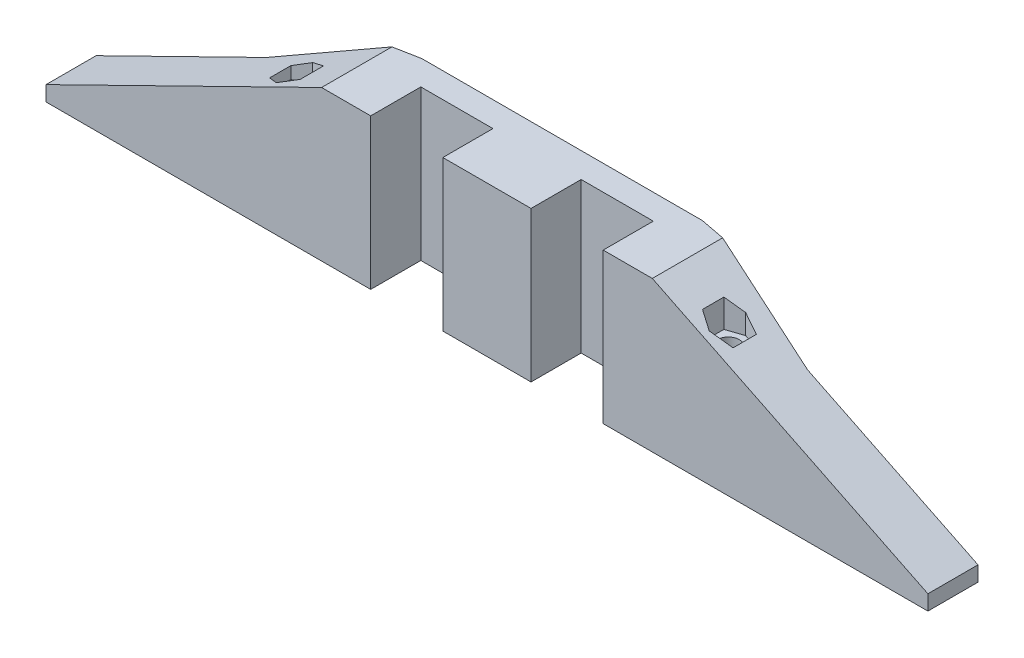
ISO-10303-21;
HEADER;
FILE_DESCRIPTION(('STEP AP214'),'2;1');
FILE_NAME('part.step','',(''),(''),'','','');
FILE_SCHEMA(('AUTOMOTIVE_DESIGN { 1 0 10303 214 1 1 1 1 }'));
ENDSEC;
DATA;
#1=APPLICATION_CONTEXT('core data for automotive mechanical design processes');
#2=APPLICATION_PROTOCOL_DEFINITION('international standard','automotive_design',2000,#1);
#3=PRODUCT_CONTEXT('',#1,'mechanical');
#4=PRODUCT('Part','Part','',(#3));
#5=PRODUCT_RELATED_PRODUCT_CATEGORY('part','',(#4));
#6=PRODUCT_DEFINITION_FORMATION('','',#4);
#7=PRODUCT_DEFINITION_CONTEXT('part definition',#1,'design');
#8=PRODUCT_DEFINITION('design','',#6,#7);
#9=PRODUCT_DEFINITION_SHAPE('','',#8);
#10=(LENGTH_UNIT() NAMED_UNIT(*) SI_UNIT(.MILLI.,.METRE.));
#11=(NAMED_UNIT(*) PLANE_ANGLE_UNIT() SI_UNIT($,.RADIAN.));
#12=(NAMED_UNIT(*) SI_UNIT($,.STERADIAN.) SOLID_ANGLE_UNIT());
#13=UNCERTAINTY_MEASURE_WITH_UNIT(LENGTH_MEASURE(1.E-05),#10,'distance_accuracy_value','');
#14=(GEOMETRIC_REPRESENTATION_CONTEXT(3) GLOBAL_UNCERTAINTY_ASSIGNED_CONTEXT((#13)) GLOBAL_UNIT_ASSIGNED_CONTEXT((#10,
#11,#12)) REPRESENTATION_CONTEXT('',''));
#15=CARTESIAN_POINT('',(0.,0.,0.));
#16=DIRECTION('',(0.,0.,1.));
#17=DIRECTION('',(1.,0.,0.));
#18=AXIS2_PLACEMENT_3D('',#15,#16,#17);
#19=CARTESIAN_POINT('',(-26.8621995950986,54.7192954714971,53.3666684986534));
#20=DIRECTION('',(0.440673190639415,-0.89766761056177,0.));
#21=DIRECTION('',(0.89766761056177,0.440673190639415,0.));
#22=AXIS2_PLACEMENT_3D('',#19,#20,#21);
#23=PLANE('',#22);
#24=DIRECTION('',(0.,0.,-1.));
#25=VECTOR('',#24,1.);
#26=CARTESIAN_POINT('',(-132.21632,3.,53.3666684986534));
#27=LINE('',#26,#25);
#28=CARTESIAN_POINT('',(-132.21632,3.,-7.9032262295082));
#29=VERTEX_POINT('',#28);
#30=CARTESIAN_POINT('',(-132.21632,3.,-17.9032262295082));
#31=VERTEX_POINT('',#30);
#32=EDGE_CURVE('E329',#29,#31,#27,.T.);
#33=ORIENTED_EDGE('',*,*,#32,.F.);
#34=DIRECTION('',(0.89766761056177,0.440673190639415,0.));
#35=VECTOR('',#34,1.);
#36=CARTESIAN_POINT('',(-26.8621995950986,54.7192954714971,-7.9032262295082));
#37=LINE('',#36,#35);
#38=CARTESIAN_POINT('',(-77.21632,30.,-7.9032262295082));
#39=VERTEX_POINT('',#38);
#40=EDGE_CURVE('E328',#29,#39,#37,.T.);
#41=ORIENTED_EDGE('',*,*,#40,.T.);
#42=DIRECTION('',(0.,0.,-1.));
#43=VECTOR('',#42,1.);
#44=CARTESIAN_POINT('',(-77.21632,30.,53.3666684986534));
#45=LINE('',#44,#43);
#46=CARTESIAN_POINT('',(-77.21632,30.,-21.9416877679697));
#47=VERTEX_POINT('',#46);
#48=EDGE_CURVE('E316',#39,#47,#45,.T.);
#49=ORIENTED_EDGE('',*,*,#48,.T.);
#50=DIRECTION('',(0.884583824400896,0.434250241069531,-0.170112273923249));
#51=VECTOR('',#50,1.);
#52=CARTESIAN_POINT('',(-9.92678716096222,63.0330433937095,-34.8819825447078));
#53=LINE('',#52,#51);
#54=CARTESIAN_POINT('',(-98.2163199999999,19.6909090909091,-17.9032262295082));
#55=VERTEX_POINT('',#54);
#56=EDGE_CURVE('E448',#55,#47,#53,.T.);
#57=ORIENTED_EDGE('',*,*,#56,.F.);
#58=DIRECTION('',(0.89766761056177,0.440673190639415,0.));
#59=VECTOR('',#58,1.);
#60=CARTESIAN_POINT('',(-133.40305415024,2.41742141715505,-17.9032262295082));
#61=LINE('',#60,#59);
#62=EDGE_CURVE('E322',#31,#55,#61,.T.);
#63=ORIENTED_EDGE('',*,*,#62,.F.);
#64=EDGE_LOOP('',(#33,#41,#49,#57,#63));
#65=FACE_BOUND('',#64,.T.);
#66=DIRECTION('',(-0.859150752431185,-0.421764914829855,0.289783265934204));
#67=VECTOR('',#66,1.);
#68=CARTESIAN_POINT('',(-49.3001737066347,43.7042899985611,-29.1893241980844));
#69=LINE('',#68,#67);
#70=CARTESIAN_POINT('',(-87.41632,24.9927272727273,-16.3331155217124));
#71=VERTEX_POINT('',#70);
#72=CARTESIAN_POINT('',(-90.66632,23.3972727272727,-15.2369218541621));
#73=VERTEX_POINT('',#72);
#74=EDGE_CURVE('E11',#71,#73,#69,.T.);
#75=ORIENTED_EDGE('',*,*,#74,.F.);
#76=DIRECTION('',(-0.859150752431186,-0.421764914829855,-0.289783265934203));
#77=VECTOR('',#76,1.);
#78=CARTESIAN_POINT('',(-14.594210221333,60.7417629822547,8.22908004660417));
#79=LINE('',#78,#77);
#80=CARTESIAN_POINT('',(-84.16632,26.5881818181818,-15.2369218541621));
#81=VERTEX_POINT('',#80);
#82=EDGE_CURVE('E45',#81,#71,#79,.T.);
#83=ORIENTED_EDGE('',*,*,#82,.F.);
#84=DIRECTION('',(0.,0.,-1.));
#85=VECTOR('',#84,1.);
#86=CARTESIAN_POINT('',(-84.1663199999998,26.5881818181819,53.3666684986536));
#87=LINE('',#86,#85);
#88=CARTESIAN_POINT('',(-84.16632,26.5881818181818,-10.5695306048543));
#89=VERTEX_POINT('',#88);
#90=EDGE_CURVE('E477',#89,#81,#87,.T.);
#91=ORIENTED_EDGE('',*,*,#90,.F.);
#92=DIRECTION('',(-0.859150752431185,-0.421764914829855,0.289783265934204));
#93=VECTOR('',#92,1.);
#94=CARTESIAN_POINT('',(-47.5923117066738,44.5426949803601,-22.9055910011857));
#95=LINE('',#94,#93);
#96=CARTESIAN_POINT('',(-87.7231647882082,24.8420943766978,-9.36984114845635));
#97=VERTEX_POINT('',#96);
#98=EDGE_CURVE('E474',#89,#97,#95,.T.);
#99=ORIENTED_EDGE('',*,*,#98,.T.);
#100=DIRECTION('',(-0.80650539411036,-0.395920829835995,-0.439085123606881));
#101=VECTOR('',#100,1.);
#102=CARTESIAN_POINT('',(-16.3793983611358,59.8653978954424,29.4717918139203));
#103=LINE('',#102,#101);
#104=CARTESIAN_POINT('',(-90.66632,23.3972727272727,-10.9721809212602));
#105=VERTEX_POINT('',#104);
#106=EDGE_CURVE('E471',#97,#105,#103,.T.);
#107=ORIENTED_EDGE('',*,*,#106,.T.);
#108=DIRECTION('',(0.,0.,-1.));
#109=VECTOR('',#108,1.);
#110=CARTESIAN_POINT('',(-90.66632,23.3972727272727,53.3666684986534));
#111=LINE('',#110,#109);
#112=EDGE_CURVE('E469',#105,#73,#111,.T.);
#113=ORIENTED_EDGE('',*,*,#112,.T.);
#114=EDGE_LOOP('',(#75,#83,#91,#99,#107,#113));
#115=FACE_BOUND('',#114,.T.);
#116=ADVANCED_FACE('F37',(#65,#115),#23,.F.);
#117=CARTESIAN_POINT('',(9.68921223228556,19.737284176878,53.3666684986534));
#118=DIRECTION('',(0.440673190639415,0.89766761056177,0.));
#119=DIRECTION('',(-0.89766761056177,0.440673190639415,0.));
#120=AXIS2_PLACEMENT_3D('',#117,#118,#119);
#121=PLANE('',#120);
#122=DIRECTION('',(0.884583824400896,-0.434250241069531,0.170112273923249));
#123=VECTOR('',#122,1.);
#124=CARTESIAN_POINT('',(-9.30832526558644,29.0633480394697,-21.5747657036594));
#125=LINE('',#124,#123);
#126=CARTESIAN_POINT('',(-11.21632,30.,-21.9416877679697));
#127=VERTEX_POINT('',#126);
#128=CARTESIAN_POINT('',(9.78368000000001,19.6909090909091,-17.9032262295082));
#129=VERTEX_POINT('',#128);
#130=EDGE_CURVE('E451',#127,#129,#125,.T.);
#131=ORIENTED_EDGE('',*,*,#130,.F.);
#132=DIRECTION('',(0.,0.,-1.));
#133=VECTOR('',#132,1.);
#134=CARTESIAN_POINT('',(-11.21632,30.,53.3666684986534));
#135=LINE('',#134,#133);
#136=CARTESIAN_POINT('',(-11.21632,30.,-7.9032262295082));
#137=VERTEX_POINT('',#136);
#138=EDGE_CURVE('E325',#137,#127,#135,.T.);
#139=ORIENTED_EDGE('',*,*,#138,.F.);
#140=DIRECTION('',(-0.89766761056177,0.440673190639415,0.));
#141=VECTOR('',#140,1.);
#142=CARTESIAN_POINT('',(9.68921223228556,19.737284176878,-7.9032262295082));
#143=LINE('',#142,#141);
#144=CARTESIAN_POINT('',(43.78368,3.,-7.9032262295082));
#145=VERTEX_POINT('',#144);
#146=EDGE_CURVE('E319',#145,#137,#143,.T.);
#147=ORIENTED_EDGE('',*,*,#146,.F.);
#148=DIRECTION('',(0.,0.,-1.));
#149=VECTOR('',#148,1.);
#150=CARTESIAN_POINT('',(43.78368,3.,53.3666684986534));
#151=LINE('',#150,#149);
#152=CARTESIAN_POINT('',(43.78368,3.,-17.9032262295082));
#153=VERTEX_POINT('',#152);
#154=EDGE_CURVE('E323',#145,#153,#151,.T.);
#155=ORIENTED_EDGE('',*,*,#154,.T.);
#156=DIRECTION('',(0.89766761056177,-0.440673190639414,0.));
#157=VECTOR('',#156,1.);
#158=CARTESIAN_POINT('',(44.9704141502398,2.41742141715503,-17.9032262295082));
#159=LINE('',#158,#157);
#160=EDGE_CURVE('E336',#129,#153,#159,.T.);
#161=ORIENTED_EDGE('',*,*,#160,.F.);
#162=EDGE_LOOP('',(#131,#139,#147,#155,#161));
#163=FACE_BOUND('',#162,.T.);
#164=DIRECTION('',(0.859150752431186,-0.421764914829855,0.289783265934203));
#165=VECTOR('',#164,1.);
#166=CARTESIAN_POINT('',(26.143203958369,11.6598700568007,-7.17246992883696));
#167=LINE('',#166,#165);
#168=CARTESIAN_POINT('',(-1.01631999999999,24.9927272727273,-16.3331155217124));
#169=VERTEX_POINT('',#168);
#170=CARTESIAN_POINT('',(2.23367999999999,23.3972727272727,-15.2369218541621));
#171=VERTEX_POINT('',#170);
#172=EDGE_CURVE('E454',#169,#171,#167,.T.);
#173=ORIENTED_EDGE('',*,*,#172,.T.);
#174=DIRECTION('',(0.,0.,1.));
#175=VECTOR('',#174,1.);
#176=CARTESIAN_POINT('',(2.2336800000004,23.3972727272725,53.3666684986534));
#177=LINE('',#176,#175);
#178=CARTESIAN_POINT('',(2.23368000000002,23.3972727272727,-10.5695306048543));
#179=VERTEX_POINT('',#178);
#180=EDGE_CURVE('E466',#171,#179,#177,.T.);
#181=ORIENTED_EDGE('',*,*,#180,.T.);
#182=DIRECTION('',(0.859150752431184,-0.421764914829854,-0.28978326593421));
#183=VECTOR('',#182,1.);
#184=CARTESIAN_POINT('',(-6.85489752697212,27.8589380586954,-7.50404102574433));
#185=LINE('',#184,#183);
#186=CARTESIAN_POINT('',(-1.32316478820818,25.1433601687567,-9.36984114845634));
#187=VERTEX_POINT('',#186);
#188=EDGE_CURVE('E464',#187,#179,#185,.T.);
#189=ORIENTED_EDGE('',*,*,#188,.F.);
#190=DIRECTION('',(0.806505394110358,-0.395920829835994,0.439085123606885));
#191=VECTOR('',#190,1.);
#192=CARTESIAN_POINT('',(29.7826091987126,9.87325293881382,7.56505192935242));
#193=LINE('',#192,#191);
#194=CARTESIAN_POINT('',(-4.26631999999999,26.5881818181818,-10.9721809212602));
#195=VERTEX_POINT('',#194);
#196=EDGE_CURVE('E462',#195,#187,#193,.T.);
#197=ORIENTED_EDGE('',*,*,#196,.F.);
#198=DIRECTION('',(0.,0.,1.));
#199=VECTOR('',#198,1.);
#200=CARTESIAN_POINT('',(-4.26631999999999,26.5881818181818,53.3666684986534));
#201=LINE('',#200,#199);
#202=CARTESIAN_POINT('',(-4.26631999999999,26.5881818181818,-15.2369218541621));
#203=VERTEX_POINT('',#202);
#204=EDGE_CURVE('E460',#203,#195,#201,.T.);
#205=ORIENTED_EDGE('',*,*,#204,.F.);
#206=DIRECTION('',(0.859150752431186,-0.421764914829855,-0.289783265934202));
#207=VECTOR('',#206,1.);
#208=CARTESIAN_POINT('',(-8.56275952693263,28.6973430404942,-13.7877742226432));
#209=LINE('',#208,#207);
#210=EDGE_CURVE('E457',#203,#169,#209,.T.);
#211=ORIENTED_EDGE('',*,*,#210,.T.);
#212=EDGE_LOOP('',(#173,#181,#189,#197,#205,#211));
#213=FACE_BOUND('',#212,.T.);
#214=ADVANCED_FACE('F501',(#163,#213),#121,.T.);
#215=CARTESIAN_POINT('',(-1.01631999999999,60.,-12.9032262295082));
#216=DIRECTION('',(0.,-1.,0.));
#217=DIRECTION('',(0.,0.,-1.));
#218=AXIS2_PLACEMENT_3D('',#215,#216,#217);
#219=CYLINDRICAL_SURFACE('',#218,2.1);
#220=CARTESIAN_POINT('',(-1.01631999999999,0.,-12.9032262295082));
#221=DIRECTION('',(0.,-1.,0.));
#222=DIRECTION('',(0.,0.,-1.));
#223=AXIS2_PLACEMENT_3D('',#220,#221,#222);
#224=CIRCLE('',#223,2.1);
#225=CARTESIAN_POINT('',(-1.01631999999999,0.,-15.0032262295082));
#226=VERTEX_POINT('',#225);
#227=EDGE_CURVE('E313',#226,#226,#224,.T.);
#228=CARTESIAN_POINT('',(-1.01631999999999,21.,-12.9032262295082));
#229=DIRECTION('',(0.,1.,0.));
#230=DIRECTION('',(0.,0.,1.));
#231=AXIS2_PLACEMENT_3D('',#228,#229,#230);
#232=CIRCLE('',#231,2.1);
#233=CARTESIAN_POINT('',(-1.01631999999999,21.,-15.0032262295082));
#234=VERTEX_POINT('',#233);
#235=EDGE_CURVE('E295',#234,#234,#232,.T.);
#236=CARTESIAN_POINT('',(-1.01631999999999,0.,-15.0032262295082));
#237=CARTESIAN_POINT('',(-1.01631999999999,0.218749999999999,-15.0032262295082));
#238=CARTESIAN_POINT('',(-1.01631999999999,0.437499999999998,-15.0032262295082));
#239=CARTESIAN_POINT('',(-1.01631999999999,0.874999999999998,-15.0032262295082));
#240=CARTESIAN_POINT('',(-1.01631999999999,1.09375,-15.0032262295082));
#241=CARTESIAN_POINT('',(-1.01631999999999,1.53125,-15.0032262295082));
#242=CARTESIAN_POINT('',(-1.01631999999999,1.75,-15.0032262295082));
#243=CARTESIAN_POINT('',(-1.01631999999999,2.1875,-15.0032262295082));
#244=CARTESIAN_POINT('',(-1.01631999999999,2.40625,-15.0032262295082));
#245=CARTESIAN_POINT('',(-1.01631999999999,2.84375,-15.0032262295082));
#246=CARTESIAN_POINT('',(-1.01631999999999,3.0625,-15.0032262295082));
#247=CARTESIAN_POINT('',(-1.01631999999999,3.5,-15.0032262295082));
#248=CARTESIAN_POINT('',(-1.01631999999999,3.71875,-15.0032262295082));
#249=CARTESIAN_POINT('',(-1.01631999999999,4.15625,-15.0032262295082));
#250=CARTESIAN_POINT('',(-1.01631999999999,4.375,-15.0032262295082));
#251=CARTESIAN_POINT('',(-1.01631999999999,4.8125,-15.0032262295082));
#252=CARTESIAN_POINT('',(-1.01631999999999,5.03125,-15.0032262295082));
#253=CARTESIAN_POINT('',(-1.01631999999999,5.46875,-15.0032262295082));
#254=CARTESIAN_POINT('',(-1.01631999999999,5.6875,-15.0032262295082));
#255=CARTESIAN_POINT('',(-1.01631999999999,6.125,-15.0032262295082));
#256=CARTESIAN_POINT('',(-1.01631999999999,6.34375,-15.0032262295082));
#257=CARTESIAN_POINT('',(-1.01631999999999,6.78125,-15.0032262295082));
#258=CARTESIAN_POINT('',(-1.01631999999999,7.,-15.0032262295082));
#259=CARTESIAN_POINT('',(-1.01631999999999,7.4375,-15.0032262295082));
#260=CARTESIAN_POINT('',(-1.01631999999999,7.65624999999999,-15.0032262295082));
#261=CARTESIAN_POINT('',(-1.01631999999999,8.09374999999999,-15.0032262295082));
#262=CARTESIAN_POINT('',(-1.01631999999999,8.31249999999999,-15.0032262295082));
#263=CARTESIAN_POINT('',(-1.01631999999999,8.75,-15.0032262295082));
#264=CARTESIAN_POINT('',(-1.01631999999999,8.96875,-15.0032262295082));
#265=CARTESIAN_POINT('',(-1.01631999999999,9.40625,-15.0032262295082));
#266=CARTESIAN_POINT('',(-1.01631999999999,9.625,-15.0032262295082));
#267=CARTESIAN_POINT('',(-1.01631999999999,10.0625,-15.0032262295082));
#268=CARTESIAN_POINT('',(-1.01631999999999,10.28125,-15.0032262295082));
#269=CARTESIAN_POINT('',(-1.01631999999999,10.71875,-15.0032262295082));
#270=CARTESIAN_POINT('',(-1.01631999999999,10.9375,-15.0032262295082));
#271=CARTESIAN_POINT('',(-1.01631999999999,11.375,-15.0032262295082));
#272=CARTESIAN_POINT('',(-1.01631999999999,11.59375,-15.0032262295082));
#273=CARTESIAN_POINT('',(-1.01631999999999,12.03125,-15.0032262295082));
#274=CARTESIAN_POINT('',(-1.01631999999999,12.25,-15.0032262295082));
#275=CARTESIAN_POINT('',(-1.01631999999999,12.6875,-15.0032262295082));
#276=CARTESIAN_POINT('',(-1.01631999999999,12.90625,-15.0032262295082));
#277=CARTESIAN_POINT('',(-1.01631999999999,13.34375,-15.0032262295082));
#278=CARTESIAN_POINT('',(-1.01631999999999,13.5625,-15.0032262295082));
#279=CARTESIAN_POINT('',(-1.01631999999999,14.,-15.0032262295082));
#280=CARTESIAN_POINT('',(-1.01631999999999,14.21875,-15.0032262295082));
#281=CARTESIAN_POINT('',(-1.01631999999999,14.65625,-15.0032262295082));
#282=CARTESIAN_POINT('',(-1.01631999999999,14.875,-15.0032262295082));
#283=CARTESIAN_POINT('',(-1.01631999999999,15.3125,-15.0032262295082));
#284=CARTESIAN_POINT('',(-1.01631999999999,15.53125,-15.0032262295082));
#285=CARTESIAN_POINT('',(-1.01631999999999,15.96875,-15.0032262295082));
#286=CARTESIAN_POINT('',(-1.01631999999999,16.1875,-15.0032262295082));
#287=CARTESIAN_POINT('',(-1.01631999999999,16.625,-15.0032262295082));
#288=CARTESIAN_POINT('',(-1.01631999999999,16.84375,-15.0032262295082));
#289=CARTESIAN_POINT('',(-1.01631999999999,17.28125,-15.0032262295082));
#290=CARTESIAN_POINT('',(-1.01631999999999,17.5,-15.0032262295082));
#291=CARTESIAN_POINT('',(-1.01631999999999,17.9375,-15.0032262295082));
#292=CARTESIAN_POINT('',(-1.01631999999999,18.15625,-15.0032262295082));
#293=CARTESIAN_POINT('',(-1.01631999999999,18.59375,-15.0032262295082));
#294=CARTESIAN_POINT('',(-1.01631999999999,18.8125,-15.0032262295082));
#295=CARTESIAN_POINT('',(-1.01631999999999,19.25,-15.0032262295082));
#296=CARTESIAN_POINT('',(-1.01631999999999,19.46875,-15.0032262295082));
#297=CARTESIAN_POINT('',(-1.01631999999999,19.90625,-15.0032262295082));
#298=CARTESIAN_POINT('',(-1.01631999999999,20.125,-15.0032262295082));
#299=CARTESIAN_POINT('',(-1.01631999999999,20.5625,-15.0032262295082));
#300=CARTESIAN_POINT('',(-1.01631999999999,20.78125,-15.0032262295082));
#301=CARTESIAN_POINT('',(-1.01631999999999,21.,-15.0032262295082));
#302=B_SPLINE_CURVE_WITH_KNOTS('',3,(#236,#237,#238,#239,#240,#241,#242,#243,#244,#245,#246,
#247,#248,#249,#250,#251,#252,#253,#254,#255,#256,#257,#258,#259,#260,#261,#262,#263,#264,#265,
#266,#267,#268,#269,#270,#271,#272,#273,#274,#275,#276,#277,#278,#279,#280,#281,#282,#283,#284,
#285,#286,#287,#288,#289,#290,#291,#292,#293,#294,#295,#296,#297,#298,#299,#300,#301),
.UNSPECIFIED.,.F.,.F.,(4,2,2,2,2,2,2,2,2,2,2,2,2,2,2,2,2,2,2,2,2,2,2,2,2,2,2,2,2,2,2,2,4),(0.,
0.656249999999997,1.3125,1.96875,2.625,3.28125,3.9375,4.59375,5.25,5.90624999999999,6.5625,
7.21875,7.87499999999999,8.53125,9.18749999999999,9.84375,10.5,11.15625,11.8125,12.46875,13.125,
13.78125,14.4375,15.09375,15.75,16.40625,17.0625,17.71875,18.375,19.03125,19.6875,20.34375,21.),.UNSPECIFIED.);
#303=EDGE_CURVE('BSEAM507',#226,#234,#302,.T.);
#304=ORIENTED_EDGE('',*,*,#227,.T.);
#305=ORIENTED_EDGE('',*,*,#235,.T.);
#306=ORIENTED_EDGE('',*,*,#303,.T.);
#307=ORIENTED_EDGE('',*,*,#303,.F.);
#308=EDGE_LOOP('',(#304,#306,#305,#307));
#309=FACE_BOUND('',#308,.T.);
#310=ADVANCED_FACE('F507',(#309),#219,.F.);
#311=CARTESIAN_POINT('',(-87.41632,60.,-12.9032262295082));
#312=DIRECTION('',(0.,-1.,0.));
#313=DIRECTION('',(0.,0.,-1.));
#314=AXIS2_PLACEMENT_3D('',#311,#312,#313);
#315=CYLINDRICAL_SURFACE('',#314,2.1);
#316=CARTESIAN_POINT('',(-87.41632,0.,-12.9032262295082));
#317=DIRECTION('',(0.,-1.,0.));
#318=DIRECTION('',(0.,0.,-1.));
#319=AXIS2_PLACEMENT_3D('',#316,#317,#318);
#320=CIRCLE('',#319,2.1);
#321=CARTESIAN_POINT('',(-87.41632,0.,-15.0032262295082));
#322=VERTEX_POINT('',#321);
#323=EDGE_CURVE('E269',#322,#322,#320,.T.);
#324=CARTESIAN_POINT('',(-87.41632,21.,-12.9032262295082));
#325=DIRECTION('',(0.,1.,0.));
#326=DIRECTION('',(0.,0.,1.));
#327=AXIS2_PLACEMENT_3D('',#324,#325,#326);
#328=CIRCLE('',#327,2.1);
#329=CARTESIAN_POINT('',(-87.41632,21.,-15.0032262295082));
#330=VERTEX_POINT('',#329);
#331=EDGE_CURVE('E240',#330,#330,#328,.T.);
#332=CARTESIAN_POINT('',(-87.41632,0.,-15.0032262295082));
#333=CARTESIAN_POINT('',(-87.41632,0.218749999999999,-15.0032262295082));
#334=CARTESIAN_POINT('',(-87.41632,0.437499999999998,-15.0032262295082));
#335=CARTESIAN_POINT('',(-87.41632,0.874999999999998,-15.0032262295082));
#336=CARTESIAN_POINT('',(-87.41632,1.09375,-15.0032262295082));
#337=CARTESIAN_POINT('',(-87.41632,1.53125,-15.0032262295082));
#338=CARTESIAN_POINT('',(-87.41632,1.75,-15.0032262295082));
#339=CARTESIAN_POINT('',(-87.41632,2.1875,-15.0032262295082));
#340=CARTESIAN_POINT('',(-87.41632,2.40625,-15.0032262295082));
#341=CARTESIAN_POINT('',(-87.41632,2.84375,-15.0032262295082));
#342=CARTESIAN_POINT('',(-87.41632,3.0625,-15.0032262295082));
#343=CARTESIAN_POINT('',(-87.41632,3.5,-15.0032262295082));
#344=CARTESIAN_POINT('',(-87.41632,3.71875,-15.0032262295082));
#345=CARTESIAN_POINT('',(-87.41632,4.15625,-15.0032262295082));
#346=CARTESIAN_POINT('',(-87.41632,4.375,-15.0032262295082));
#347=CARTESIAN_POINT('',(-87.41632,4.8125,-15.0032262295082));
#348=CARTESIAN_POINT('',(-87.41632,5.03125,-15.0032262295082));
#349=CARTESIAN_POINT('',(-87.41632,5.46875,-15.0032262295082));
#350=CARTESIAN_POINT('',(-87.41632,5.6875,-15.0032262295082));
#351=CARTESIAN_POINT('',(-87.41632,6.125,-15.0032262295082));
#352=CARTESIAN_POINT('',(-87.41632,6.34375,-15.0032262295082));
#353=CARTESIAN_POINT('',(-87.41632,6.78125,-15.0032262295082));
#354=CARTESIAN_POINT('',(-87.41632,7.,-15.0032262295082));
#355=CARTESIAN_POINT('',(-87.41632,7.4375,-15.0032262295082));
#356=CARTESIAN_POINT('',(-87.41632,7.65624999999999,-15.0032262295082));
#357=CARTESIAN_POINT('',(-87.41632,8.09374999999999,-15.0032262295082));
#358=CARTESIAN_POINT('',(-87.41632,8.31249999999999,-15.0032262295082));
#359=CARTESIAN_POINT('',(-87.41632,8.75,-15.0032262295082));
#360=CARTESIAN_POINT('',(-87.41632,8.96875,-15.0032262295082));
#361=CARTESIAN_POINT('',(-87.41632,9.40625,-15.0032262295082));
#362=CARTESIAN_POINT('',(-87.41632,9.625,-15.0032262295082));
#363=CARTESIAN_POINT('',(-87.41632,10.0625,-15.0032262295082));
#364=CARTESIAN_POINT('',(-87.41632,10.28125,-15.0032262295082));
#365=CARTESIAN_POINT('',(-87.41632,10.71875,-15.0032262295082));
#366=CARTESIAN_POINT('',(-87.41632,10.9375,-15.0032262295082));
#367=CARTESIAN_POINT('',(-87.41632,11.375,-15.0032262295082));
#368=CARTESIAN_POINT('',(-87.41632,11.59375,-15.0032262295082));
#369=CARTESIAN_POINT('',(-87.41632,12.03125,-15.0032262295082));
#370=CARTESIAN_POINT('',(-87.41632,12.25,-15.0032262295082));
#371=CARTESIAN_POINT('',(-87.41632,12.6875,-15.0032262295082));
#372=CARTESIAN_POINT('',(-87.41632,12.90625,-15.0032262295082));
#373=CARTESIAN_POINT('',(-87.41632,13.34375,-15.0032262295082));
#374=CARTESIAN_POINT('',(-87.41632,13.5625,-15.0032262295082));
#375=CARTESIAN_POINT('',(-87.41632,14.,-15.0032262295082));
#376=CARTESIAN_POINT('',(-87.41632,14.21875,-15.0032262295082));
#377=CARTESIAN_POINT('',(-87.41632,14.65625,-15.0032262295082));
#378=CARTESIAN_POINT('',(-87.41632,14.875,-15.0032262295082));
#379=CARTESIAN_POINT('',(-87.41632,15.3125,-15.0032262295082));
#380=CARTESIAN_POINT('',(-87.41632,15.53125,-15.0032262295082));
#381=CARTESIAN_POINT('',(-87.41632,15.96875,-15.0032262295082));
#382=CARTESIAN_POINT('',(-87.41632,16.1875,-15.0032262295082));
#383=CARTESIAN_POINT('',(-87.41632,16.625,-15.0032262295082));
#384=CARTESIAN_POINT('',(-87.41632,16.84375,-15.0032262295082));
#385=CARTESIAN_POINT('',(-87.41632,17.28125,-15.0032262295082));
#386=CARTESIAN_POINT('',(-87.41632,17.5,-15.0032262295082));
#387=CARTESIAN_POINT('',(-87.41632,17.9375,-15.0032262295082));
#388=CARTESIAN_POINT('',(-87.41632,18.15625,-15.0032262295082));
#389=CARTESIAN_POINT('',(-87.41632,18.59375,-15.0032262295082));
#390=CARTESIAN_POINT('',(-87.41632,18.8125,-15.0032262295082));
#391=CARTESIAN_POINT('',(-87.41632,19.25,-15.0032262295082));
#392=CARTESIAN_POINT('',(-87.41632,19.46875,-15.0032262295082));
#393=CARTESIAN_POINT('',(-87.41632,19.90625,-15.0032262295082));
#394=CARTESIAN_POINT('',(-87.41632,20.125,-15.0032262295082));
#395=CARTESIAN_POINT('',(-87.41632,20.5625,-15.0032262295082));
#396=CARTESIAN_POINT('',(-87.41632,20.78125,-15.0032262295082));
#397=CARTESIAN_POINT('',(-87.41632,21.,-15.0032262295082));
#398=B_SPLINE_CURVE_WITH_KNOTS('',3,(#332,#333,#334,#335,#336,#337,#338,#339,#340,#341,#342,
#343,#344,#345,#346,#347,#348,#349,#350,#351,#352,#353,#354,#355,#356,#357,#358,#359,#360,#361,
#362,#363,#364,#365,#366,#367,#368,#369,#370,#371,#372,#373,#374,#375,#376,#377,#378,#379,#380,
#381,#382,#383,#384,#385,#386,#387,#388,#389,#390,#391,#392,#393,#394,#395,#396,#397),
.UNSPECIFIED.,.F.,.F.,(4,2,2,2,2,2,2,2,2,2,2,2,2,2,2,2,2,2,2,2,2,2,2,2,2,2,2,2,2,2,2,2,4),(0.,
0.656249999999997,1.3125,1.96875,2.625,3.28125,3.9375,4.59375,5.25,5.90624999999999,6.5625,
7.21875,7.87499999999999,8.53125,9.18749999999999,9.84375,10.5,11.15625,11.8125,12.46875,13.125,
13.78125,14.4375,15.09375,15.75,16.40625,17.0625,17.71875,18.375,19.03125,19.6875,20.34375,21.),.UNSPECIFIED.);
#399=EDGE_CURVE('BSEAM556',#322,#330,#398,.T.);
#400=ORIENTED_EDGE('',*,*,#323,.T.);
#401=ORIENTED_EDGE('',*,*,#331,.T.);
#402=ORIENTED_EDGE('',*,*,#399,.T.);
#403=ORIENTED_EDGE('',*,*,#399,.F.);
#404=EDGE_LOOP('',(#400,#402,#401,#403));
#405=FACE_BOUND('',#404,.T.);
#406=ADVANCED_FACE('F556',(#405),#315,.F.);
#407=CARTESIAN_POINT('',(0.,30.,0.));
#408=DIRECTION('',(0.,1.,0.));
#409=DIRECTION('',(0.,0.,1.));
#410=AXIS2_PLACEMENT_3D('',#407,#408,#409);
#411=PLANE('',#410);
#412=DIRECTION('',(1.,0.,0.));
#413=VECTOR('',#412,1.);
#414=CARTESIAN_POINT('',(-21.01632,30.,-7.9032262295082));
#415=LINE('',#414,#413);
#416=CARTESIAN_POINT('',(-21.01632,30.,-7.9032262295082));
#417=VERTEX_POINT('',#416);
#418=EDGE_CURVE('E384',#417,#137,#415,.T.);
#419=ORIENTED_EDGE('',*,*,#418,.T.);
#420=ORIENTED_EDGE('',*,*,#138,.T.);
#421=DIRECTION('',(0.982006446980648,0.,0.188847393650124));
#422=VECTOR('',#421,1.);
#423=CARTESIAN_POINT('',(3.66906049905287,30.,-19.079114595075));
#424=LINE('',#423,#422);
#425=CARTESIAN_POINT('',(-16.21632,30.,-22.9032262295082));
#426=VERTEX_POINT('',#425);
#427=EDGE_CURVE('E350',#426,#127,#424,.T.);
#428=ORIENTED_EDGE('',*,*,#427,.F.);
#429=DIRECTION('',(-1.,0.,0.));
#430=VECTOR('',#429,1.);
#431=CARTESIAN_POINT('',(-48.21632,30.,-22.9032262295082));
#432=LINE('',#431,#430);
#433=CARTESIAN_POINT('',(-72.21632,30.,-22.9032262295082));
#434=VERTEX_POINT('',#433);
#435=EDGE_CURVE('E410',#426,#434,#432,.T.);
#436=ORIENTED_EDGE('',*,*,#435,.T.);
#437=DIRECTION('',(-0.982006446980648,0.,0.188847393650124));
#438=VECTOR('',#437,1.);
#439=CARTESIAN_POINT('',(-6.82286363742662,30.,-35.4788909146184));
#440=LINE('',#439,#438);
#441=EDGE_CURVE('E343',#434,#47,#440,.T.);
#442=ORIENTED_EDGE('',*,*,#441,.T.);
#443=ORIENTED_EDGE('',*,*,#48,.F.);
#444=DIRECTION('',(1.,0.,0.));
#445=VECTOR('',#444,1.);
#446=CARTESIAN_POINT('',(-72.21632,30.,-7.9032262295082));
#447=LINE('',#446,#445);
#448=CARTESIAN_POINT('',(-67.41632,30.,-7.9032262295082));
#449=VERTEX_POINT('',#448);
#450=EDGE_CURVE('E412',#39,#449,#447,.T.);
#451=ORIENTED_EDGE('',*,*,#450,.T.);
#452=DIRECTION('',(0.,0.,-1.));
#453=VECTOR('',#452,1.);
#454=CARTESIAN_POINT('',(-67.41632,30.,-7.9032262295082));
#455=LINE('',#454,#453);
#456=CARTESIAN_POINT('',(-67.41632,30.,-17.9032262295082));
#457=VERTEX_POINT('',#456);
#458=EDGE_CURVE('E415',#449,#457,#455,.T.);
#459=ORIENTED_EDGE('',*,*,#458,.T.);
#460=DIRECTION('',(1.,0.,0.));
#461=VECTOR('',#460,1.);
#462=CARTESIAN_POINT('',(-67.41632,30.,-17.9032262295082));
#463=LINE('',#462,#461);
#464=CARTESIAN_POINT('',(-53.01632,30.,-17.9032262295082));
#465=VERTEX_POINT('',#464);
#466=EDGE_CURVE('E417',#457,#465,#463,.T.);
#467=ORIENTED_EDGE('',*,*,#466,.T.);
#468=DIRECTION('',(0.,0.,1.));
#469=VECTOR('',#468,1.);
#470=CARTESIAN_POINT('',(-53.01632,30.,-17.9032262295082));
#471=LINE('',#470,#469);
#472=CARTESIAN_POINT('',(-53.01632,30.,-7.9032262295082));
#473=VERTEX_POINT('',#472);
#474=EDGE_CURVE('E419',#465,#473,#471,.T.);
#475=ORIENTED_EDGE('',*,*,#474,.T.);
#476=DIRECTION('',(1.,0.,0.));
#477=VECTOR('',#476,1.);
#478=CARTESIAN_POINT('',(-53.01632,30.,-7.9032262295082));
#479=LINE('',#478,#477);
#480=CARTESIAN_POINT('',(-35.41632,30.,-7.9032262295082));
#481=VERTEX_POINT('',#480);
#482=EDGE_CURVE('E421',#473,#481,#479,.T.);
#483=ORIENTED_EDGE('',*,*,#482,.T.);
#484=DIRECTION('',(0.,0.,-1.));
#485=VECTOR('',#484,1.);
#486=CARTESIAN_POINT('',(-35.41632,30.,-7.9032262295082));
#487=LINE('',#486,#485);
#488=CARTESIAN_POINT('',(-35.41632,30.,-17.9032262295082));
#489=VERTEX_POINT('',#488);
#490=EDGE_CURVE('E377',#481,#489,#487,.T.);
#491=ORIENTED_EDGE('',*,*,#490,.T.);
#492=DIRECTION('',(1.,0.,0.));
#493=VECTOR('',#492,1.);
#494=CARTESIAN_POINT('',(-35.41632,30.,-17.9032262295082));
#495=LINE('',#494,#493);
#496=CARTESIAN_POINT('',(-21.01632,30.,-17.9032262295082));
#497=VERTEX_POINT('',#496);
#498=EDGE_CURVE('E379',#489,#497,#495,.T.);
#499=ORIENTED_EDGE('',*,*,#498,.T.);
#500=DIRECTION('',(0.,0.,1.));
#501=VECTOR('',#500,1.);
#502=CARTESIAN_POINT('',(-21.01632,30.,-17.9032262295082));
#503=LINE('',#502,#501);
#504=EDGE_CURVE('E382',#497,#417,#503,.T.);
#505=ORIENTED_EDGE('',*,*,#504,.T.);
#506=EDGE_LOOP('',(#419,#420,#428,#436,#442,#443,#451,#459,#467,#475,#483,#491,#499,#505));
#507=FACE_BOUND('',#506,.T.);
#508=ADVANCED_FACE('F540',(#507),#411,.T.);
#509=CARTESIAN_POINT('',(-21.01632,30.,-7.9032262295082));
#510=DIRECTION('',(0.,0.,-1.));
#511=DIRECTION('',(-1.,0.,0.));
#512=AXIS2_PLACEMENT_3D('',#509,#510,#511);
#513=PLANE('',#512);
#514=ORIENTED_EDGE('',*,*,#146,.T.);
#515=ORIENTED_EDGE('',*,*,#418,.F.);
#516=DIRECTION('',(0.,-1.,0.));
#517=VECTOR('',#516,1.);
#518=CARTESIAN_POINT('',(-21.01632,30.,-7.9032262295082));
#519=LINE('',#518,#517);
#520=CARTESIAN_POINT('',(-21.01632,0.,-7.9032262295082));
#521=VERTEX_POINT('',#520);
#522=EDGE_CURVE('E397',#417,#521,#519,.T.);
#523=ORIENTED_EDGE('',*,*,#522,.T.);
#524=DIRECTION('',(1.,0.,0.));
#525=VECTOR('',#524,1.);
#526=CARTESIAN_POINT('',(-21.01632,0.,-7.9032262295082));
#527=LINE('',#526,#525);
#528=CARTESIAN_POINT('',(43.78368,0.,-7.9032262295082));
#529=VERTEX_POINT('',#528);
#530=EDGE_CURVE('E380',#521,#529,#527,.T.);
#531=ORIENTED_EDGE('',*,*,#530,.T.);
#532=DIRECTION('',(0.,-1.,0.));
#533=VECTOR('',#532,1.);
#534=CARTESIAN_POINT('',(43.78368,0.,-7.9032262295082));
#535=LINE('',#534,#533);
#536=EDGE_CURVE('E357',#145,#529,#535,.T.);
#537=ORIENTED_EDGE('',*,*,#536,.F.);
#538=EDGE_LOOP('',(#514,#515,#523,#531,#537));
#539=FACE_BOUND('',#538,.T.);
#540=ADVANCED_FACE('F529',(#539),#513,.F.);
#541=CARTESIAN_POINT('',(43.78368,0.,-17.9032262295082));
#542=DIRECTION('',(0.,0.,-1.));
#543=DIRECTION('',(-1.,0.,0.));
#544=AXIS2_PLACEMENT_3D('',#541,#542,#543);
#545=PLANE('',#544);
#546=DIRECTION('',(0.,-1.,0.));
#547=VECTOR('',#546,1.);
#548=CARTESIAN_POINT('',(9.78368000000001,56.4764045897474,-17.9032262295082));
#549=LINE('',#548,#547);
#550=CARTESIAN_POINT('',(9.78368000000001,0.,-17.9032262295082));
#551=VERTEX_POINT('',#550);
#552=EDGE_CURVE('E353',#129,#551,#549,.T.);
#553=ORIENTED_EDGE('',*,*,#552,.F.);
#554=ORIENTED_EDGE('',*,*,#160,.T.);
#555=DIRECTION('',(0.,-1.,0.));
#556=VECTOR('',#555,1.);
#557=CARTESIAN_POINT('',(43.78368,0.,-17.9032262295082));
#558=LINE('',#557,#556);
#559=CARTESIAN_POINT('',(43.78368,0.,-17.9032262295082));
#560=VERTEX_POINT('',#559);
#561=EDGE_CURVE('E355',#153,#560,#558,.T.);
#562=ORIENTED_EDGE('',*,*,#561,.T.);
#563=DIRECTION('',(-1.,0.,0.));
#564=VECTOR('',#563,1.);
#565=CARTESIAN_POINT('',(43.78368,0.,-17.9032262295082));
#566=LINE('',#565,#564);
#567=EDGE_CURVE('E362',#560,#551,#566,.T.);
#568=ORIENTED_EDGE('',*,*,#567,.T.);
#569=EDGE_LOOP('',(#553,#554,#562,#568));
#570=FACE_BOUND('',#569,.T.);
#571=ADVANCED_FACE('F525',(#570),#545,.T.);
#572=CARTESIAN_POINT('',(43.78368,0.,0.));
#573=DIRECTION('',(1.,0.,0.));
#574=DIRECTION('',(0.,0.,-1.));
#575=AXIS2_PLACEMENT_3D('',#572,#573,#574);
#576=PLANE('',#575);
#577=ORIENTED_EDGE('',*,*,#561,.F.);
#578=ORIENTED_EDGE('',*,*,#154,.F.);
#579=ORIENTED_EDGE('',*,*,#536,.T.);
#580=DIRECTION('',(0.,0.,-1.));
#581=VECTOR('',#580,1.);
#582=CARTESIAN_POINT('',(43.78368,0.,0.));
#583=LINE('',#582,#581);
#584=EDGE_CURVE('E359',#529,#560,#583,.T.);
#585=ORIENTED_EDGE('',*,*,#584,.T.);
#586=EDGE_LOOP('',(#577,#578,#579,#585));
#587=FACE_BOUND('',#586,.T.);
#588=ADVANCED_FACE('F521',(#587),#576,.T.);
#589=CARTESIAN_POINT('',(3.66906049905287,56.4764045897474,-19.079114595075));
#590=DIRECTION('',(0.188847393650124,0.,-0.982006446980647));
#591=DIRECTION('',(-0.982006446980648,0.,-0.188847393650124));
#592=AXIS2_PLACEMENT_3D('',#589,#590,#591);
#593=PLANE('',#592);
#594=ORIENTED_EDGE('',*,*,#427,.T.);
#595=ORIENTED_EDGE('',*,*,#130,.T.);
#596=ORIENTED_EDGE('',*,*,#552,.T.);
#597=DIRECTION('',(0.982006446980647,0.,0.188847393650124));
#598=VECTOR('',#597,1.);
#599=CARTESIAN_POINT('',(3.66906049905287,0.,-19.079114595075));
#600=LINE('',#599,#598);
#601=CARTESIAN_POINT('',(-16.21632,0.,-22.9032262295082));
#602=VERTEX_POINT('',#601);
#603=EDGE_CURVE('E346',#602,#551,#600,.T.);
#604=ORIENTED_EDGE('',*,*,#603,.F.);
#605=DIRECTION('',(0.,-1.,0.));
#606=VECTOR('',#605,1.);
#607=CARTESIAN_POINT('',(-16.21632,30.,-22.9032262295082));
#608=LINE('',#607,#606);
#609=EDGE_CURVE('E387',#426,#602,#608,.T.);
#610=ORIENTED_EDGE('',*,*,#609,.F.);
#611=EDGE_LOOP('',(#594,#595,#596,#604,#610));
#612=FACE_BOUND('',#611,.T.);
#613=ADVANCED_FACE('F517',(#612),#593,.T.);
#614=CARTESIAN_POINT('',(-132.21632,0.,-17.9032262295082));
#615=DIRECTION('',(0.,0.,1.));
#616=DIRECTION('',(1.,0.,0.));
#617=AXIS2_PLACEMENT_3D('',#614,#615,#616);
#618=PLANE('',#617);
#619=DIRECTION('',(0.,-1.,0.));
#620=VECTOR('',#619,1.);
#621=CARTESIAN_POINT('',(-132.21632,0.,-17.9032262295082));
#622=LINE('',#621,#620);
#623=CARTESIAN_POINT('',(-132.21632,0.,-17.9032262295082));
#624=VERTEX_POINT('',#623);
#625=EDGE_CURVE('E365',#31,#624,#622,.T.);
#626=ORIENTED_EDGE('',*,*,#625,.F.);
#627=ORIENTED_EDGE('',*,*,#62,.T.);
#628=DIRECTION('',(0.,-1.,0.));
#629=VECTOR('',#628,1.);
#630=CARTESIAN_POINT('',(-98.2163199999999,56.4764045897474,-17.9032262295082));
#631=LINE('',#630,#629);
#632=CARTESIAN_POINT('',(-98.2163199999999,0.,-17.9032262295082));
#633=VERTEX_POINT('',#632);
#634=EDGE_CURVE('E342',#55,#633,#631,.T.);
#635=ORIENTED_EDGE('',*,*,#634,.T.);
#636=DIRECTION('',(1.,0.,0.));
#637=VECTOR('',#636,1.);
#638=CARTESIAN_POINT('',(-132.21632,0.,-17.9032262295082));
#639=LINE('',#638,#637);
#640=EDGE_CURVE('E373',#624,#633,#639,.T.);
#641=ORIENTED_EDGE('',*,*,#640,.F.);
#642=EDGE_LOOP('',(#626,#627,#635,#641));
#643=FACE_BOUND('',#642,.T.);
#644=ADVANCED_FACE('F520',(#643),#618,.F.);
#645=CARTESIAN_POINT('',(-48.21632,30.,-22.9032262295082));
#646=DIRECTION('',(0.,0.,1.));
#647=DIRECTION('',(1.,0.,0.));
#648=AXIS2_PLACEMENT_3D('',#645,#646,#647);
#649=PLANE('',#648);
#650=DIRECTION('',(-1.,0.,0.));
#651=VECTOR('',#650,1.);
#652=CARTESIAN_POINT('',(-48.21632,0.,-22.9032262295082));
#653=LINE('',#652,#651);
#654=CARTESIAN_POINT('',(-72.21632,0.,-22.9032262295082));
#655=VERTEX_POINT('',#654);
#656=EDGE_CURVE('E409',#602,#655,#653,.T.);
#657=ORIENTED_EDGE('',*,*,#656,.T.);
#658=DIRECTION('',(0.,-1.,0.));
#659=VECTOR('',#658,1.);
#660=CARTESIAN_POINT('',(-72.21632,30.,-22.9032262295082));
#661=LINE('',#660,#659);
#662=EDGE_CURVE('E445',#434,#655,#661,.T.);
#663=ORIENTED_EDGE('',*,*,#662,.F.);
#664=ORIENTED_EDGE('',*,*,#435,.F.);
#665=ORIENTED_EDGE('',*,*,#609,.T.);
#666=EDGE_LOOP('',(#657,#663,#664,#665));
#667=FACE_BOUND('',#666,.T.);
#668=ADVANCED_FACE('F39',(#667),#649,.F.);
#669=CARTESIAN_POINT('',(-72.21632,30.,-7.9032262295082));
#670=DIRECTION('',(0.,0.,-1.));
#671=DIRECTION('',(-1.,0.,0.));
#672=AXIS2_PLACEMENT_3D('',#669,#670,#671);
#673=PLANE('',#672);
#674=ORIENTED_EDGE('',*,*,#450,.F.);
#675=ORIENTED_EDGE('',*,*,#40,.F.);
#676=DIRECTION('',(0.,1.,0.));
#677=VECTOR('',#676,1.);
#678=CARTESIAN_POINT('',(-132.21632,0.,-7.9032262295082));
#679=LINE('',#678,#677);
#680=CARTESIAN_POINT('',(-132.21632,0.,-7.9032262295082));
#681=VERTEX_POINT('',#680);
#682=EDGE_CURVE('E370',#681,#29,#679,.T.);
#683=ORIENTED_EDGE('',*,*,#682,.F.);
#684=DIRECTION('',(1.,0.,0.));
#685=VECTOR('',#684,1.);
#686=CARTESIAN_POINT('',(-72.21632,0.,-7.9032262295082));
#687=LINE('',#686,#685);
#688=CARTESIAN_POINT('',(-67.41632,0.,-7.9032262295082));
#689=VERTEX_POINT('',#688);
#690=EDGE_CURVE('E425',#681,#689,#687,.T.);
#691=ORIENTED_EDGE('',*,*,#690,.T.);
#692=DIRECTION('',(0.,-1.,0.));
#693=VECTOR('',#692,1.);
#694=CARTESIAN_POINT('',(-67.41632,30.,-7.9032262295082));
#695=LINE('',#694,#693);
#696=EDGE_CURVE('E442',#449,#689,#695,.T.);
#697=ORIENTED_EDGE('',*,*,#696,.F.);
#698=EDGE_LOOP('',(#674,#675,#683,#691,#697));
#699=FACE_BOUND('',#698,.T.);
#700=ADVANCED_FACE('F575',(#699),#673,.F.);
#701=CARTESIAN_POINT('',(-67.41632,30.,-7.9032262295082));
#702=DIRECTION('',(-1.,0.,0.));
#703=DIRECTION('',(0.,0.,1.));
#704=AXIS2_PLACEMENT_3D('',#701,#702,#703);
#705=PLANE('',#704);
#706=DIRECTION('',(0.,0.,-1.));
#707=VECTOR('',#706,1.);
#708=CARTESIAN_POINT('',(-67.41632,0.,-7.9032262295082));
#709=LINE('',#708,#707);
#710=CARTESIAN_POINT('',(-67.41632,0.,-17.9032262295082));
#711=VERTEX_POINT('',#710);
#712=EDGE_CURVE('E427',#689,#711,#709,.T.);
#713=ORIENTED_EDGE('',*,*,#712,.T.);
#714=DIRECTION('',(0.,-1.,0.));
#715=VECTOR('',#714,1.);
#716=CARTESIAN_POINT('',(-67.41632,30.,-17.9032262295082));
#717=LINE('',#716,#715);
#718=EDGE_CURVE('E439',#457,#711,#717,.T.);
#719=ORIENTED_EDGE('',*,*,#718,.F.);
#720=ORIENTED_EDGE('',*,*,#458,.F.);
#721=ORIENTED_EDGE('',*,*,#696,.T.);
#722=EDGE_LOOP('',(#713,#719,#720,#721));
#723=FACE_BOUND('',#722,.T.);
#724=ADVANCED_FACE('F572',(#723),#705,.F.);
#725=CARTESIAN_POINT('',(-67.41632,30.,-17.9032262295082));
#726=DIRECTION('',(0.,0.,-1.));
#727=DIRECTION('',(-1.,0.,0.));
#728=AXIS2_PLACEMENT_3D('',#725,#726,#727);
#729=PLANE('',#728);
#730=DIRECTION('',(1.,0.,0.));
#731=VECTOR('',#730,1.);
#732=CARTESIAN_POINT('',(-67.41632,0.,-17.9032262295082));
#733=LINE('',#732,#731);
#734=CARTESIAN_POINT('',(-53.01632,0.,-17.9032262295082));
#735=VERTEX_POINT('',#734);
#736=EDGE_CURVE('E429',#711,#735,#733,.T.);
#737=ORIENTED_EDGE('',*,*,#736,.T.);
#738=DIRECTION('',(0.,-1.,0.));
#739=VECTOR('',#738,1.);
#740=CARTESIAN_POINT('',(-53.01632,30.,-17.9032262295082));
#741=LINE('',#740,#739);
#742=EDGE_CURVE('E436',#465,#735,#741,.T.);
#743=ORIENTED_EDGE('',*,*,#742,.F.);
#744=ORIENTED_EDGE('',*,*,#466,.F.);
#745=ORIENTED_EDGE('',*,*,#718,.T.);
#746=EDGE_LOOP('',(#737,#743,#744,#745));
#747=FACE_BOUND('',#746,.T.);
#748=ADVANCED_FACE('F568',(#747),#729,.F.);
#749=CARTESIAN_POINT('',(-53.01632,30.,-17.9032262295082));
#750=DIRECTION('',(1.,0.,0.));
#751=DIRECTION('',(0.,0.,-1.));
#752=AXIS2_PLACEMENT_3D('',#749,#750,#751);
#753=PLANE('',#752);
#754=DIRECTION('',(0.,0.,1.));
#755=VECTOR('',#754,1.);
#756=CARTESIAN_POINT('',(-53.01632,0.,-17.9032262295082));
#757=LINE('',#756,#755);
#758=CARTESIAN_POINT('',(-53.01632,0.,-7.9032262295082));
#759=VERTEX_POINT('',#758);
#760=EDGE_CURVE('E431',#735,#759,#757,.T.);
#761=ORIENTED_EDGE('',*,*,#760,.T.);
#762=DIRECTION('',(0.,-1.,0.));
#763=VECTOR('',#762,1.);
#764=CARTESIAN_POINT('',(-53.01632,30.,-7.9032262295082));
#765=LINE('',#764,#763);
#766=EDGE_CURVE('E423',#473,#759,#765,.T.);
#767=ORIENTED_EDGE('',*,*,#766,.F.);
#768=ORIENTED_EDGE('',*,*,#474,.F.);
#769=ORIENTED_EDGE('',*,*,#742,.T.);
#770=EDGE_LOOP('',(#761,#767,#768,#769));
#771=FACE_BOUND('',#770,.T.);
#772=ADVANCED_FACE('F564',(#771),#753,.F.);
#773=CARTESIAN_POINT('',(-53.01632,30.,-7.9032262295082));
#774=DIRECTION('',(0.,0.,-1.));
#775=DIRECTION('',(-1.,0.,0.));
#776=AXIS2_PLACEMENT_3D('',#773,#774,#775);
#777=PLANE('',#776);
#778=DIRECTION('',(1.,0.,0.));
#779=VECTOR('',#778,1.);
#780=CARTESIAN_POINT('',(-53.01632,0.,-7.9032262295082));
#781=LINE('',#780,#779);
#782=CARTESIAN_POINT('',(-35.41632,0.,-7.9032262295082));
#783=VERTEX_POINT('',#782);
#784=EDGE_CURVE('E413',#759,#783,#781,.T.);
#785=ORIENTED_EDGE('',*,*,#784,.T.);
#786=DIRECTION('',(0.,-1.,0.));
#787=VECTOR('',#786,1.);
#788=CARTESIAN_POINT('',(-35.41632,30.,-7.9032262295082));
#789=LINE('',#788,#787);
#790=EDGE_CURVE('E406',#481,#783,#789,.T.);
#791=ORIENTED_EDGE('',*,*,#790,.F.);
#792=ORIENTED_EDGE('',*,*,#482,.F.);
#793=ORIENTED_EDGE('',*,*,#766,.T.);
#794=EDGE_LOOP('',(#785,#791,#792,#793));
#795=FACE_BOUND('',#794,.T.);
#796=ADVANCED_FACE('F560',(#795),#777,.F.);
#797=CARTESIAN_POINT('',(0.,0.,0.));
#798=DIRECTION('',(0.,1.,0.));
#799=DIRECTION('',(0.,0.,1.));
#800=AXIS2_PLACEMENT_3D('',#797,#798,#799);
#801=PLANE('',#800);
#802=ORIENTED_EDGE('',*,*,#227,.F.);
#803=EDGE_LOOP('',(#802));
#804=FACE_BOUND('',#803,.T.);
#805=ORIENTED_EDGE('',*,*,#323,.F.);
#806=EDGE_LOOP('',(#805));
#807=FACE_BOUND('',#806,.T.);
#808=ORIENTED_EDGE('',*,*,#656,.F.);
#809=ORIENTED_EDGE('',*,*,#603,.T.);
#810=ORIENTED_EDGE('',*,*,#567,.F.);
#811=ORIENTED_EDGE('',*,*,#584,.F.);
#812=ORIENTED_EDGE('',*,*,#530,.F.);
#813=DIRECTION('',(0.,0.,1.));
#814=VECTOR('',#813,1.);
#815=CARTESIAN_POINT('',(-21.01632,0.,-17.9032262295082));
#816=LINE('',#815,#814);
#817=CARTESIAN_POINT('',(-21.01632,0.,-17.9032262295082));
#818=VERTEX_POINT('',#817);
#819=EDGE_CURVE('E391',#818,#521,#816,.T.);
#820=ORIENTED_EDGE('',*,*,#819,.F.);
#821=DIRECTION('',(1.,0.,0.));
#822=VECTOR('',#821,1.);
#823=CARTESIAN_POINT('',(-35.41632,0.,-17.9032262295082));
#824=LINE('',#823,#822);
#825=CARTESIAN_POINT('',(-35.41632,0.,-17.9032262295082));
#826=VERTEX_POINT('',#825);
#827=EDGE_CURVE('E389',#826,#818,#824,.T.);
#828=ORIENTED_EDGE('',*,*,#827,.F.);
#829=DIRECTION('',(0.,0.,-1.));
#830=VECTOR('',#829,1.);
#831=CARTESIAN_POINT('',(-35.41632,0.,-7.9032262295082));
#832=LINE('',#831,#830);
#833=EDGE_CURVE('E376',#783,#826,#832,.T.);
#834=ORIENTED_EDGE('',*,*,#833,.F.);
#835=ORIENTED_EDGE('',*,*,#784,.F.);
#836=ORIENTED_EDGE('',*,*,#760,.F.);
#837=ORIENTED_EDGE('',*,*,#736,.F.);
#838=ORIENTED_EDGE('',*,*,#712,.F.);
#839=ORIENTED_EDGE('',*,*,#690,.F.);
#840=DIRECTION('',(0.,0.,1.));
#841=VECTOR('',#840,1.);
#842=CARTESIAN_POINT('',(-132.21632,0.,0.));
#843=LINE('',#842,#841);
#844=EDGE_CURVE('E367',#624,#681,#843,.T.);
#845=ORIENTED_EDGE('',*,*,#844,.F.);
#846=ORIENTED_EDGE('',*,*,#640,.T.);
#847=DIRECTION('',(-0.982006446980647,0.,0.188847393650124));
#848=VECTOR('',#847,1.);
#849=CARTESIAN_POINT('',(-6.82286363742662,0.,-35.4788909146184));
#850=LINE('',#849,#848);
#851=EDGE_CURVE('E339',#655,#633,#850,.T.);
#852=ORIENTED_EDGE('',*,*,#851,.F.);
#853=EDGE_LOOP('',(#808,#809,#810,#811,#812,#820,#828,#834,#835,#836,#837,#838,#839,#845,#846,#852));
#854=FACE_BOUND('',#853,.T.);
#855=ADVANCED_FACE('F552',(#804,#807,#854),#801,.F.);
#856=CARTESIAN_POINT('',(-35.41632,30.,-7.9032262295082));
#857=DIRECTION('',(-1.,0.,0.));
#858=DIRECTION('',(0.,0.,1.));
#859=AXIS2_PLACEMENT_3D('',#856,#857,#858);
#860=PLANE('',#859);
#861=ORIENTED_EDGE('',*,*,#833,.T.);
#862=DIRECTION('',(0.,-1.,0.));
#863=VECTOR('',#862,1.);
#864=CARTESIAN_POINT('',(-35.41632,30.,-17.9032262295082));
#865=LINE('',#864,#863);
#866=EDGE_CURVE('E403',#489,#826,#865,.T.);
#867=ORIENTED_EDGE('',*,*,#866,.F.);
#868=ORIENTED_EDGE('',*,*,#490,.F.);
#869=ORIENTED_EDGE('',*,*,#790,.T.);
#870=EDGE_LOOP('',(#861,#867,#868,#869));
#871=FACE_BOUND('',#870,.T.);
#872=ADVANCED_FACE('F548',(#871),#860,.F.);
#873=CARTESIAN_POINT('',(-35.41632,30.,-17.9032262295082));
#874=DIRECTION('',(0.,0.,-1.));
#875=DIRECTION('',(-1.,0.,0.));
#876=AXIS2_PLACEMENT_3D('',#873,#874,#875);
#877=PLANE('',#876);
#878=ORIENTED_EDGE('',*,*,#827,.T.);
#879=DIRECTION('',(0.,-1.,0.));
#880=VECTOR('',#879,1.);
#881=CARTESIAN_POINT('',(-21.01632,30.,-17.9032262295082));
#882=LINE('',#881,#880);
#883=EDGE_CURVE('E400',#497,#818,#882,.T.);
#884=ORIENTED_EDGE('',*,*,#883,.F.);
#885=ORIENTED_EDGE('',*,*,#498,.F.);
#886=ORIENTED_EDGE('',*,*,#866,.T.);
#887=EDGE_LOOP('',(#878,#884,#885,#886));
#888=FACE_BOUND('',#887,.T.);
#889=ADVANCED_FACE('F544',(#888),#877,.F.);
#890=CARTESIAN_POINT('',(-21.01632,30.,-17.9032262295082));
#891=DIRECTION('',(1.,0.,0.));
#892=DIRECTION('',(0.,0.,-1.));
#893=AXIS2_PLACEMENT_3D('',#890,#891,#892);
#894=PLANE('',#893);
#895=ORIENTED_EDGE('',*,*,#819,.T.);
#896=ORIENTED_EDGE('',*,*,#522,.F.);
#897=ORIENTED_EDGE('',*,*,#504,.F.);
#898=ORIENTED_EDGE('',*,*,#883,.T.);
#899=EDGE_LOOP('',(#895,#896,#897,#898));
#900=FACE_BOUND('',#899,.T.);
#901=ADVANCED_FACE('F533',(#900),#894,.F.);
#902=CARTESIAN_POINT('',(-132.21632,0.,0.));
#903=DIRECTION('',(-1.,0.,0.));
#904=DIRECTION('',(0.,0.,1.));
#905=AXIS2_PLACEMENT_3D('',#902,#903,#904);
#906=PLANE('',#905);
#907=ORIENTED_EDGE('',*,*,#32,.T.);
#908=ORIENTED_EDGE('',*,*,#625,.T.);
#909=ORIENTED_EDGE('',*,*,#844,.T.);
#910=ORIENTED_EDGE('',*,*,#682,.T.);
#911=EDGE_LOOP('',(#907,#908,#909,#910));
#912=FACE_BOUND('',#911,.T.);
#913=ADVANCED_FACE('F515',(#912),#906,.T.);
#914=CARTESIAN_POINT('',(-6.82286363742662,56.4764045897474,-35.4788909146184));
#915=DIRECTION('',(0.188847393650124,0.,0.982006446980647));
#916=DIRECTION('',(0.982006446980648,0.,-0.188847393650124));
#917=AXIS2_PLACEMENT_3D('',#914,#915,#916);
#918=PLANE('',#917);
#919=ORIENTED_EDGE('',*,*,#634,.F.);
#920=ORIENTED_EDGE('',*,*,#56,.T.);
#921=ORIENTED_EDGE('',*,*,#441,.F.);
#922=ORIENTED_EDGE('',*,*,#662,.T.);
#923=ORIENTED_EDGE('',*,*,#851,.T.);
#924=EDGE_LOOP('',(#919,#920,#921,#922,#923));
#925=FACE_BOUND('',#924,.T.);
#926=ADVANCED_FACE('F512',(#925),#918,.F.);
#927=CARTESIAN_POINT('',(-13.8753725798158,21.,-41.1377680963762));
#928=DIRECTION('',(0.319600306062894,0.,0.947552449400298));
#929=DIRECTION('',(0.947552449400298,0.,-0.319600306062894));
#930=AXIS2_PLACEMENT_3D('',#927,#928,#929);
#931=PLANE('',#930);
#932=ORIENTED_EDGE('',*,*,#74,.T.);
#933=DIRECTION('',(0.,1.,0.));
#934=VECTOR('',#933,1.);
#935=CARTESIAN_POINT('',(-90.66632,21.,-15.2369218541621));
#936=LINE('',#935,#934);
#937=CARTESIAN_POINT('',(-90.66632,21.,-15.2369218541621));
#938=VERTEX_POINT('',#937);
#939=EDGE_CURVE('E52',#938,#73,#936,.T.);
#940=ORIENTED_EDGE('',*,*,#939,.F.);
#941=DIRECTION('',(0.947552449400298,0.,-0.319600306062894));
#942=VECTOR('',#941,1.);
#943=CARTESIAN_POINT('',(-13.8753725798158,21.,-41.1377680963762));
#944=LINE('',#943,#942);
#945=CARTESIAN_POINT('',(-87.41632,21.,-16.3331155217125));
#946=VERTEX_POINT('',#945);
#947=EDGE_CURVE('E235',#938,#946,#944,.T.);
#948=ORIENTED_EDGE('',*,*,#947,.T.);
#949=DIRECTION('',(0.,1.,0.));
#950=VECTOR('',#949,1.);
#951=CARTESIAN_POINT('',(-87.41632,21.,-16.3331155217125));
#952=LINE('',#951,#950);
#953=EDGE_CURVE('E267',#946,#71,#952,.T.);
#954=ORIENTED_EDGE('',*,*,#953,.T.);
#955=EDGE_LOOP('',(#932,#940,#948,#954));
#956=FACE_BOUND('',#955,.T.);
#957=ADVANCED_FACE('F233',(#956),#931,.T.);
#958=CARTESIAN_POINT('',(-3.98279477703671,21.,11.8082081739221));
#959=DIRECTION('',(-0.319600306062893,0.,0.947552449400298));
#960=DIRECTION('',(0.947552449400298,0.,0.319600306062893));
#961=AXIS2_PLACEMENT_3D('',#958,#959,#960);
#962=PLANE('',#961);
#963=ORIENTED_EDGE('',*,*,#82,.T.);
#964=ORIENTED_EDGE('',*,*,#953,.F.);
#965=DIRECTION('',(0.947552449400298,0.,0.319600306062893));
#966=VECTOR('',#965,1.);
#967=CARTESIAN_POINT('',(-3.98279477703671,21.,11.8082081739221));
#968=LINE('',#967,#966);
#969=CARTESIAN_POINT('',(-84.16632,21.,-15.2369218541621));
#970=VERTEX_POINT('',#969);
#971=EDGE_CURVE('E249',#946,#970,#968,.T.);
#972=ORIENTED_EDGE('',*,*,#971,.T.);
#973=DIRECTION('',(0.,1.,0.));
#974=VECTOR('',#973,1.);
#975=CARTESIAN_POINT('',(-84.16632,21.,-15.2369218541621));
#976=LINE('',#975,#974);
#977=EDGE_CURVE('E270',#970,#81,#976,.T.);
#978=ORIENTED_EDGE('',*,*,#977,.T.);
#979=EDGE_LOOP('',(#963,#964,#972,#978));
#980=FACE_BOUND('',#979,.T.);
#981=ADVANCED_FACE('F480',(#980),#962,.T.);
#982=CARTESIAN_POINT('',(-84.16632,21.,2.50255928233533E-13));
#983=DIRECTION('',(-1.,0.,0.));
#984=DIRECTION('',(0.,0.,1.));
#985=AXIS2_PLACEMENT_3D('',#982,#983,#984);
#986=PLANE('',#985);
#987=ORIENTED_EDGE('',*,*,#90,.T.);
#988=ORIENTED_EDGE('',*,*,#977,.F.);
#989=DIRECTION('',(0.,0.,1.));
#990=VECTOR('',#989,1.);
#991=CARTESIAN_POINT('',(-84.16632,21.,2.50255928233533E-13));
#992=LINE('',#991,#990);
#993=CARTESIAN_POINT('',(-84.16632,21.,-10.5695306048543));
#994=VERTEX_POINT('',#993);
#995=EDGE_CURVE('E262',#970,#994,#992,.T.);
#996=ORIENTED_EDGE('',*,*,#995,.T.);
#997=DIRECTION('',(0.,1.,0.));
#998=VECTOR('',#997,1.);
#999=CARTESIAN_POINT('',(-84.16632,21.,-10.5695306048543));
#1000=LINE('',#999,#998);
#1001=EDGE_CURVE('E273',#994,#89,#1000,.T.);
#1002=ORIENTED_EDGE('',*,*,#1001,.T.);
#1003=EDGE_LOOP('',(#987,#988,#996,#1002));
#1004=FACE_BOUND('',#1003,.T.);
#1005=ADVANCED_FACE('F491',(#1004),#986,.T.);
#1006=CARTESIAN_POINT('',(-11.797970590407,21.,-34.9786771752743));
#1007=DIRECTION('',(0.319600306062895,0.,0.947552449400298));
#1008=DIRECTION('',(0.947552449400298,0.,-0.319600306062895));
#1009=AXIS2_PLACEMENT_3D('',#1006,#1007,#1008);
#1010=PLANE('',#1009);
#1011=ORIENTED_EDGE('',*,*,#1001,.F.);
#1012=DIRECTION('',(0.947552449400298,0.,-0.319600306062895));
#1013=VECTOR('',#1012,1.);
#1014=CARTESIAN_POINT('',(-11.797970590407,21.,-34.9786771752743));
#1015=LINE('',#1014,#1013);
#1016=CARTESIAN_POINT('',(-87.7231647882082,21.,-9.36984114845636));
#1017=VERTEX_POINT('',#1016);
#1018=EDGE_CURVE('E257',#1017,#994,#1015,.T.);
#1019=ORIENTED_EDGE('',*,*,#1018,.F.);
#1020=DIRECTION('',(0.,1.,0.));
#1021=VECTOR('',#1020,1.);
#1022=CARTESIAN_POINT('',(-87.7231647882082,21.,-9.36984114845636));
#1023=LINE('',#1022,#1021);
#1024=EDGE_CURVE('E276',#1017,#97,#1023,.T.);
#1025=ORIENTED_EDGE('',*,*,#1024,.T.);
#1026=ORIENTED_EDGE('',*,*,#98,.F.);
#1027=EDGE_LOOP('',(#1011,#1019,#1025,#1026));
#1028=FACE_BOUND('',#1027,.T.);
#1029=ADVANCED_FACE('F489',(#1028),#1010,.F.);
#1030=CARTESIAN_POINT('',(-16.1216907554,21.,29.6120953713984));
#1031=DIRECTION('',(-0.478157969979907,0.,0.878273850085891));
#1032=DIRECTION('',(0.878273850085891,0.,0.478157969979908));
#1033=AXIS2_PLACEMENT_3D('',#1030,#1031,#1032);
#1034=PLANE('',#1033);
#1035=ORIENTED_EDGE('',*,*,#1024,.F.);
#1036=DIRECTION('',(0.878273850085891,0.,0.478157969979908));
#1037=VECTOR('',#1036,1.);
#1038=CARTESIAN_POINT('',(-16.1216907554,21.,29.6120953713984));
#1039=LINE('',#1038,#1037);
#1040=CARTESIAN_POINT('',(-90.66632,21.,-10.9721809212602));
#1041=VERTEX_POINT('',#1040);
#1042=EDGE_CURVE('E255',#1041,#1017,#1039,.T.);
#1043=ORIENTED_EDGE('',*,*,#1042,.F.);
#1044=DIRECTION('',(0.,1.,0.));
#1045=VECTOR('',#1044,1.);
#1046=CARTESIAN_POINT('',(-90.66632,21.,-10.9721809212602));
#1047=LINE('',#1046,#1045);
#1048=EDGE_CURVE('E239',#1041,#105,#1047,.T.);
#1049=ORIENTED_EDGE('',*,*,#1048,.T.);
#1050=ORIENTED_EDGE('',*,*,#106,.F.);
#1051=EDGE_LOOP('',(#1035,#1043,#1049,#1050));
#1052=FACE_BOUND('',#1051,.T.);
#1053=ADVANCED_FACE('F485',(#1052),#1034,.F.);
#1054=CARTESIAN_POINT('',(-90.66632,21.,0.));
#1055=DIRECTION('',(-1.,0.,0.));
#1056=DIRECTION('',(0.,0.,1.));
#1057=AXIS2_PLACEMENT_3D('',#1054,#1055,#1056);
#1058=PLANE('',#1057);
#1059=ORIENTED_EDGE('',*,*,#1048,.F.);
#1060=DIRECTION('',(0.,0.,1.));
#1061=VECTOR('',#1060,1.);
#1062=CARTESIAN_POINT('',(-90.66632,21.,0.));
#1063=LINE('',#1062,#1061);
#1064=EDGE_CURVE('E247',#938,#1041,#1063,.T.);
#1065=ORIENTED_EDGE('',*,*,#1064,.F.);
#1066=ORIENTED_EDGE('',*,*,#939,.T.);
#1067=ORIENTED_EDGE('',*,*,#112,.F.);
#1068=EDGE_LOOP('',(#1059,#1065,#1066,#1067));
#1069=FACE_BOUND('',#1068,.T.);
#1070=ADVANCED_FACE('F252',(#1069),#1058,.F.);
#1071=CARTESIAN_POINT('',(0.,21.,0.));
#1072=DIRECTION('',(0.,1.,0.));
#1073=DIRECTION('',(0.,0.,1.));
#1074=AXIS2_PLACEMENT_3D('',#1071,#1072,#1073);
#1075=PLANE('',#1074);
#1076=ORIENTED_EDGE('',*,*,#947,.F.);
#1077=ORIENTED_EDGE('',*,*,#1064,.T.);
#1078=ORIENTED_EDGE('',*,*,#1042,.T.);
#1079=ORIENTED_EDGE('',*,*,#1018,.T.);
#1080=ORIENTED_EDGE('',*,*,#995,.F.);
#1081=ORIENTED_EDGE('',*,*,#971,.F.);
#1082=EDGE_LOOP('',(#1076,#1077,#1078,#1079,#1080,#1081));
#1083=FACE_BOUND('',#1082,.T.);
#1084=ORIENTED_EDGE('',*,*,#331,.F.);
#1085=EDGE_LOOP('',(#1084));
#1086=FACE_BOUND('',#1085,.T.);
#1087=ADVANCED_FACE('F244',(#1083,#1086),#1075,.T.);
#1088=CARTESIAN_POINT('',(2.23368000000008,21.,0.));
#1089=DIRECTION('',(-1.,0.,0.));
#1090=DIRECTION('',(0.,0.,1.));
#1091=AXIS2_PLACEMENT_3D('',#1088,#1089,#1090);
#1092=PLANE('',#1091);
#1093=DIRECTION('',(0.,1.,0.));
#1094=VECTOR('',#1093,1.);
#1095=CARTESIAN_POINT('',(2.23367999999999,21.,-15.2369218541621));
#1096=LINE('',#1095,#1094);
#1097=CARTESIAN_POINT('',(2.23367999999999,21.,-15.2369218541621));
#1098=VERTEX_POINT('',#1097);
#1099=EDGE_CURVE('E59',#1098,#171,#1096,.T.);
#1100=ORIENTED_EDGE('',*,*,#1099,.F.);
#1101=DIRECTION('',(0.,0.,1.));
#1102=VECTOR('',#1101,1.);
#1103=CARTESIAN_POINT('',(2.23368000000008,21.,0.));
#1104=LINE('',#1103,#1102);
#1105=CARTESIAN_POINT('',(2.23368000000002,21.,-10.5695306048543));
#1106=VERTEX_POINT('',#1105);
#1107=EDGE_CURVE('E280',#1098,#1106,#1104,.T.);
#1108=ORIENTED_EDGE('',*,*,#1107,.T.);
#1109=DIRECTION('',(0.,1.,0.));
#1110=VECTOR('',#1109,1.);
#1111=CARTESIAN_POINT('',(2.23368000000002,21.,-10.5695306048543));
#1112=LINE('',#1111,#1110);
#1113=EDGE_CURVE('E250',#1106,#179,#1112,.T.);
#1114=ORIENTED_EDGE('',*,*,#1113,.T.);
#1115=ORIENTED_EDGE('',*,*,#180,.F.);
#1116=EDGE_LOOP('',(#1100,#1108,#1114,#1115));
#1117=FACE_BOUND('',#1116,.T.);
#1118=ADVANCED_FACE('F653',(#1117),#1092,.T.);
#1119=CARTESIAN_POINT('',(-2.97269826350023,21.,-8.81346940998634));
#1120=DIRECTION('',(0.319600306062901,0.,0.947552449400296));
#1121=DIRECTION('',(0.947552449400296,0.,-0.319600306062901));
#1122=AXIS2_PLACEMENT_3D('',#1119,#1120,#1121);
#1123=PLANE('',#1122);
#1124=ORIENTED_EDGE('',*,*,#188,.T.);
#1125=ORIENTED_EDGE('',*,*,#1113,.F.);
#1126=DIRECTION('',(0.947552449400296,0.,-0.319600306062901));
#1127=VECTOR('',#1126,1.);
#1128=CARTESIAN_POINT('',(-2.97269826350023,21.,-8.81346940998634));
#1129=LINE('',#1128,#1127);
#1130=CARTESIAN_POINT('',(-1.32316478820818,21.,-9.36984114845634));
#1131=VERTEX_POINT('',#1130);
#1132=EDGE_CURVE('E292',#1131,#1106,#1129,.T.);
#1133=ORIENTED_EDGE('',*,*,#1132,.F.);
#1134=DIRECTION('',(0.,1.,0.));
#1135=VECTOR('',#1134,1.);
#1136=CARTESIAN_POINT('',(-1.32316478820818,21.,-9.36984114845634));
#1137=LINE('',#1136,#1135);
#1138=EDGE_CURVE('E300',#1131,#187,#1137,.T.);
#1139=ORIENTED_EDGE('',*,*,#1138,.T.);
#1140=EDGE_LOOP('',(#1124,#1125,#1133,#1139));
#1141=FACE_BOUND('',#1140,.T.);
#1142=ADVANCED_FACE('F651',(#1141),#1123,.F.);
#1143=CARTESIAN_POINT('',(3.63237706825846,21.,-6.67189923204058));
#1144=DIRECTION('',(-0.478157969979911,0.,0.878273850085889));
#1145=DIRECTION('',(0.878273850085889,0.,0.478157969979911));
#1146=AXIS2_PLACEMENT_3D('',#1143,#1144,#1145);
#1147=PLANE('',#1146);
#1148=ORIENTED_EDGE('',*,*,#196,.T.);
#1149=ORIENTED_EDGE('',*,*,#1138,.F.);
#1150=DIRECTION('',(0.878273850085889,0.,0.478157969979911));
#1151=VECTOR('',#1150,1.);
#1152=CARTESIAN_POINT('',(3.63237706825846,21.,-6.67189923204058));
#1153=LINE('',#1152,#1151);
#1154=CARTESIAN_POINT('',(-4.26631999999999,21.,-10.9721809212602));
#1155=VERTEX_POINT('',#1154);
#1156=EDGE_CURVE('E289',#1155,#1131,#1153,.T.);
#1157=ORIENTED_EDGE('',*,*,#1156,.F.);
#1158=DIRECTION('',(0.,1.,0.));
#1159=VECTOR('',#1158,1.);
#1160=CARTESIAN_POINT('',(-4.26631999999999,21.,-10.9721809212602));
#1161=LINE('',#1160,#1159);
#1162=EDGE_CURVE('E303',#1155,#195,#1161,.T.);
#1163=ORIENTED_EDGE('',*,*,#1162,.T.);
#1164=EDGE_LOOP('',(#1148,#1149,#1157,#1163));
#1165=FACE_BOUND('',#1164,.T.);
#1166=ADVANCED_FACE('F647',(#1165),#1147,.F.);
#1167=CARTESIAN_POINT('',(-4.26631999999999,21.,0.));
#1168=DIRECTION('',(-1.,0.,0.));
#1169=DIRECTION('',(0.,0.,1.));
#1170=AXIS2_PLACEMENT_3D('',#1167,#1168,#1169);
#1171=PLANE('',#1170);
#1172=ORIENTED_EDGE('',*,*,#204,.T.);
#1173=ORIENTED_EDGE('',*,*,#1162,.F.);
#1174=DIRECTION('',(0.,0.,1.));
#1175=VECTOR('',#1174,1.);
#1176=CARTESIAN_POINT('',(-4.26631999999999,21.,0.));
#1177=LINE('',#1176,#1175);
#1178=CARTESIAN_POINT('',(-4.26631999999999,21.,-15.2369218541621));
#1179=VERTEX_POINT('',#1178);
#1180=EDGE_CURVE('E286',#1179,#1155,#1177,.T.);
#1181=ORIENTED_EDGE('',*,*,#1180,.F.);
#1182=DIRECTION('',(0.,1.,0.));
#1183=VECTOR('',#1182,1.);
#1184=CARTESIAN_POINT('',(-4.26631999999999,21.,-15.2369218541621));
#1185=LINE('',#1184,#1183);
#1186=EDGE_CURVE('E306',#1179,#203,#1185,.T.);
#1187=ORIENTED_EDGE('',*,*,#1186,.T.);
#1188=EDGE_LOOP('',(#1172,#1173,#1181,#1187));
#1189=FACE_BOUND('',#1188,.T.);
#1190=ADVANCED_FACE('F643',(#1189),#1171,.F.);
#1191=CARTESIAN_POINT('',(-5.05010025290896,21.,-14.9725603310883));
#1192=DIRECTION('',(0.319600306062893,0.,0.947552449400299));
#1193=DIRECTION('',(0.947552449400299,0.,-0.319600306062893));
#1194=AXIS2_PLACEMENT_3D('',#1191,#1192,#1193);
#1195=PLANE('',#1194);
#1196=ORIENTED_EDGE('',*,*,#1186,.F.);
#1197=DIRECTION('',(0.947552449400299,0.,-0.319600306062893));
#1198=VECTOR('',#1197,1.);
#1199=CARTESIAN_POINT('',(-5.05010025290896,21.,-14.9725603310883));
#1200=LINE('',#1199,#1198);
#1201=CARTESIAN_POINT('',(-1.01631999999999,21.,-16.3331155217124));
#1202=VERTEX_POINT('',#1201);
#1203=EDGE_CURVE('E284',#1179,#1202,#1200,.T.);
#1204=ORIENTED_EDGE('',*,*,#1203,.T.);
#1205=DIRECTION('',(0.,1.,0.));
#1206=VECTOR('',#1205,1.);
#1207=CARTESIAN_POINT('',(-1.01631999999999,21.,-16.3331155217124));
#1208=LINE('',#1207,#1206);
#1209=EDGE_CURVE('E309',#1202,#169,#1208,.T.);
#1210=ORIENTED_EDGE('',*,*,#1209,.T.);
#1211=ORIENTED_EDGE('',*,*,#210,.F.);
#1212=EDGE_LOOP('',(#1196,#1204,#1210,#1211));
#1213=FACE_BOUND('',#1212,.T.);
#1214=ADVANCED_FACE('F635',(#1213),#1195,.T.);
#1215=CARTESIAN_POINT('',(4.84247754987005,21.,-14.3569995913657));
#1216=DIRECTION('',(-0.319600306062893,0.,0.947552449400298));
#1217=DIRECTION('',(0.947552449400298,0.,0.319600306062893));
#1218=AXIS2_PLACEMENT_3D('',#1215,#1216,#1217);
#1219=PLANE('',#1218);
#1220=ORIENTED_EDGE('',*,*,#1209,.F.);
#1221=DIRECTION('',(0.947552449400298,0.,0.319600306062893));
#1222=VECTOR('',#1221,1.);
#1223=CARTESIAN_POINT('',(4.84247754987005,21.,-14.3569995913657));
#1224=LINE('',#1223,#1222);
#1225=EDGE_CURVE('E282',#1202,#1098,#1224,.T.);
#1226=ORIENTED_EDGE('',*,*,#1225,.T.);
#1227=ORIENTED_EDGE('',*,*,#1099,.T.);
#1228=ORIENTED_EDGE('',*,*,#172,.F.);
#1229=EDGE_LOOP('',(#1220,#1226,#1227,#1228));
#1230=FACE_BOUND('',#1229,.T.);
#1231=ADVANCED_FACE('F632',(#1230),#1219,.T.);
#1232=CARTESIAN_POINT('',(0.,21.,0.));
#1233=DIRECTION('',(0.,1.,0.));
#1234=DIRECTION('',(0.,0.,1.));
#1235=AXIS2_PLACEMENT_3D('',#1232,#1233,#1234);
#1236=PLANE('',#1235);
#1237=ORIENTED_EDGE('',*,*,#1107,.F.);
#1238=ORIENTED_EDGE('',*,*,#1225,.F.);
#1239=ORIENTED_EDGE('',*,*,#1203,.F.);
#1240=ORIENTED_EDGE('',*,*,#1180,.T.);
#1241=ORIENTED_EDGE('',*,*,#1156,.T.);
#1242=ORIENTED_EDGE('',*,*,#1132,.T.);
#1243=EDGE_LOOP('',(#1237,#1238,#1239,#1240,#1241,#1242));
#1244=FACE_BOUND('',#1243,.T.);
#1245=ORIENTED_EDGE('',*,*,#235,.F.);
#1246=EDGE_LOOP('',(#1245));
#1247=FACE_BOUND('',#1246,.T.);
#1248=ADVANCED_FACE('F640',(#1244,#1247),#1236,.T.);
#1249=CLOSED_SHELL('',(#116,#214,#310,#406,#508,#540,#571,#588,#613,#644,#668,#700,#724,#748,
#772,#796,#855,#872,#889,#901,#913,#926,#957,#981,#1005,#1029,#1053,#1070,#1087,#1118,#1142,
#1166,#1190,#1214,#1231,#1248));
#1250=MANIFOLD_SOLID_BREP('B2',#1249);
#1251=ADVANCED_BREP_SHAPE_REPRESENTATION('',(#18,#1250),#14);
#1252=SHAPE_DEFINITION_REPRESENTATION(#9,#1251);
ENDSEC;
END-ISO-10303-21;
